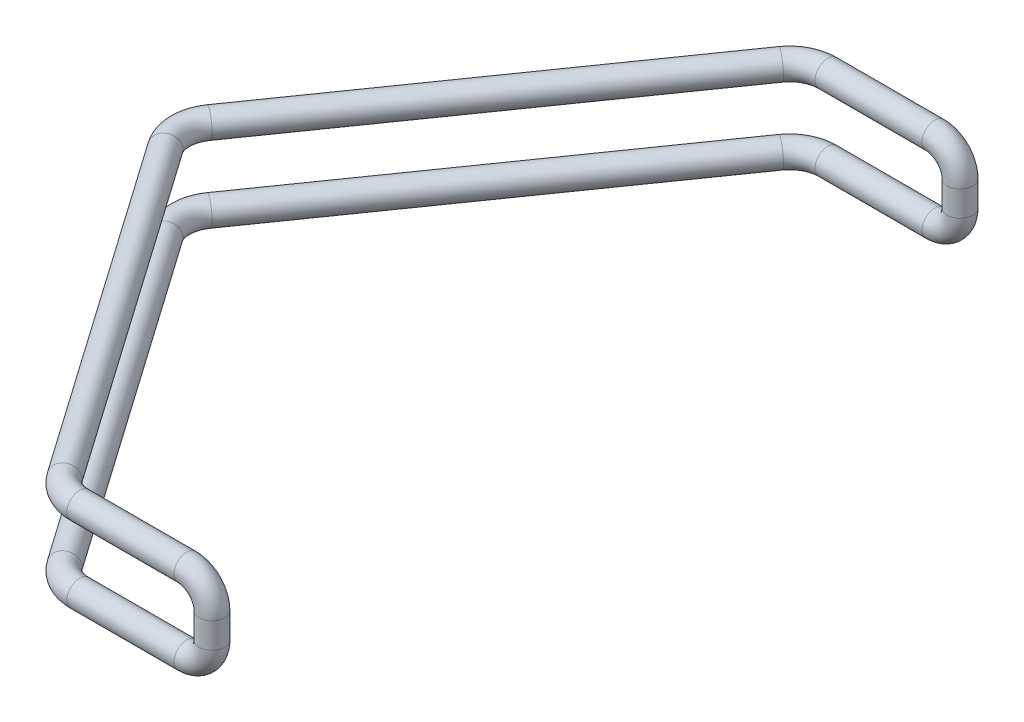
ISO-10303-21;
HEADER;
FILE_DESCRIPTION(('STEP AP214'),'2;1');
FILE_NAME('part.step','',(''),(''),'','','');
FILE_SCHEMA(('AUTOMOTIVE_DESIGN { 1 0 10303 214 1 1 1 1 }'));
ENDSEC;
DATA;
#1=APPLICATION_CONTEXT('core data for automotive mechanical design processes');
#2=APPLICATION_PROTOCOL_DEFINITION('international standard','automotive_design',2000,#1);
#3=PRODUCT_CONTEXT('',#1,'mechanical');
#4=PRODUCT('Part','Part','',(#3));
#5=PRODUCT_RELATED_PRODUCT_CATEGORY('part','',(#4));
#6=PRODUCT_DEFINITION_FORMATION('','',#4);
#7=PRODUCT_DEFINITION_CONTEXT('part definition',#1,'design');
#8=PRODUCT_DEFINITION('design','',#6,#7);
#9=PRODUCT_DEFINITION_SHAPE('','',#8);
#10=(LENGTH_UNIT() NAMED_UNIT(*) SI_UNIT(.MILLI.,.METRE.));
#11=(NAMED_UNIT(*) PLANE_ANGLE_UNIT() SI_UNIT($,.RADIAN.));
#12=(NAMED_UNIT(*) SI_UNIT($,.STERADIAN.) SOLID_ANGLE_UNIT());
#13=UNCERTAINTY_MEASURE_WITH_UNIT(LENGTH_MEASURE(1.E-05),#10,'distance_accuracy_value','');
#14=(GEOMETRIC_REPRESENTATION_CONTEXT(3) GLOBAL_UNCERTAINTY_ASSIGNED_CONTEXT((#13)) GLOBAL_UNIT_ASSIGNED_CONTEXT((#10,
#11,#12)) REPRESENTATION_CONTEXT('',''));
#15=CARTESIAN_POINT('',(0.,0.,0.));
#16=DIRECTION('',(0.,0.,1.));
#17=DIRECTION('',(1.,0.,0.));
#18=AXIS2_PLACEMENT_3D('',#15,#16,#17);
#19=CARTESIAN_POINT('',(-1.16226472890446E-13,3.17499999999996,187.258157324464));
#20=DIRECTION('',(0.,-1.,0.));
#21=DIRECTION('',(0.,0.,-1.));
#22=AXIS2_PLACEMENT_3D('',#19,#20,#21);
#23=CYLINDRICAL_SURFACE('',#22,3.175);
#24=CARTESIAN_POINT('',(-1.16226472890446E-13,3.17499999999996,187.258157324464));
#25=DIRECTION('',(0.,-1.,0.));
#26=DIRECTION('',(0.,0.,-1.));
#27=AXIS2_PLACEMENT_3D('',#24,#25,#26);
#28=CIRCLE('',#27,3.175);
#29=CARTESIAN_POINT('',(3.17499999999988,3.17499999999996,187.258157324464));
#30=VERTEX_POINT('',#29);
#31=EDGE_CURVE('E10',#30,#30,#28,.T.);
#32=ORIENTED_EDGE('',*,*,#31,.T.);
#33=EDGE_LOOP('',(#32));
#34=FACE_BOUND('',#33,.T.);
#35=CARTESIAN_POINT('',(-1.16226472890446E-13,-3.17499999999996,187.258157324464));
#36=DIRECTION('',(0.,-1.,0.));
#37=DIRECTION('',(0.,0.,-1.));
#38=AXIS2_PLACEMENT_3D('',#35,#36,#37);
#39=CIRCLE('',#38,3.175);
#40=CARTESIAN_POINT('',(3.17499999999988,-3.17499999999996,187.258157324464));
#41=VERTEX_POINT('',#40);
#42=EDGE_CURVE('E69',#41,#41,#39,.T.);
#43=ORIENTED_EDGE('',*,*,#42,.F.);
#44=EDGE_LOOP('',(#43));
#45=FACE_BOUND('',#44,.T.);
#46=ADVANCED_FACE('F32',(#34,#45),#23,.T.);
#47=CARTESIAN_POINT('',(-6.35000000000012,3.17499999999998,187.258157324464));
#48=DIRECTION('',(0.,0.,-1.));
#49=DIRECTION('',(0.,1.,0.));
#50=AXIS2_PLACEMENT_3D('',#47,#48,#49);
#51=TOROIDAL_SURFACE('',#50,6.35,3.175);
#52=CARTESIAN_POINT('',(-6.3500000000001,9.52499999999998,187.258157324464));
#53=DIRECTION('',(1.,0.,0.));
#54=DIRECTION('',(0.,0.,-1.));
#55=AXIS2_PLACEMENT_3D('',#52,#53,#54);
#56=CIRCLE('',#55,3.175);
#57=CARTESIAN_POINT('',(-6.35000000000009,12.7,187.258157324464));
#58=VERTEX_POINT('',#57);
#59=EDGE_CURVE('E38',#58,#58,#56,.T.);
#60=CARTESIAN_POINT('',(-6.35000000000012,3.17499999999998,187.258157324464));
#61=DIRECTION('',(0.,0.,-1.));
#62=DIRECTION('',(0.,1.,0.));
#63=AXIS2_PLACEMENT_3D('',#60,#61,#62);
#64=CIRCLE('',#63,9.525);
#65=EDGE_CURVE('',#58,#30,#64,.T.);
#66=ORIENTED_EDGE('',*,*,#59,.T.);
#67=ORIENTED_EDGE('',*,*,#31,.F.);
#68=ORIENTED_EDGE('',*,*,#65,.T.);
#69=ORIENTED_EDGE('',*,*,#65,.F.);
#70=EDGE_LOOP('',(#66,#68,#67,#69));
#71=FACE_BOUND('',#70,.T.);
#72=ADVANCED_FACE('F157',(#71),#51,.T.);
#73=CARTESIAN_POINT('',(-33.1415988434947,9.52499999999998,187.258157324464));
#74=DIRECTION('',(1.,0.,0.));
#75=DIRECTION('',(0.,0.,-1.));
#76=AXIS2_PLACEMENT_3D('',#73,#74,#75);
#77=CYLINDRICAL_SURFACE('',#76,3.175);
#78=CARTESIAN_POINT('',(-33.1415988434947,9.52499999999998,187.258157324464));
#79=DIRECTION('',(1.,0.,0.));
#80=DIRECTION('',(0.,0.,-1.));
#81=AXIS2_PLACEMENT_3D('',#78,#79,#80);
#82=CIRCLE('',#81,3.175);
#83=CARTESIAN_POINT('',(-33.1415988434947,9.52499999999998,190.433157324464));
#84=VERTEX_POINT('',#83);
#85=EDGE_CURVE('E42',#84,#84,#82,.T.);
#86=ORIENTED_EDGE('',*,*,#85,.T.);
#87=EDGE_LOOP('',(#86));
#88=FACE_BOUND('',#87,.T.);
#89=ORIENTED_EDGE('',*,*,#59,.F.);
#90=EDGE_LOOP('',(#89));
#91=FACE_BOUND('',#90,.T.);
#92=ADVANCED_FACE('F161',(#88,#91),#77,.T.);
#93=CARTESIAN_POINT('',(-33.1415988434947,9.52499999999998,177.733157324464));
#94=DIRECTION('',(0.,1.,0.));
#95=DIRECTION('',(0.,0.,1.));
#96=AXIS2_PLACEMENT_3D('',#93,#94,#95);
#97=TOROIDAL_SURFACE('',#96,9.525,3.175);
#98=CARTESIAN_POINT('',(-40.9440220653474,9.52499999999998,183.196472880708));
#99=DIRECTION('',(0.57357643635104,0.,0.819152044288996));
#100=DIRECTION('',(0.819152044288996,0.,-0.57357643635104));
#101=AXIS2_PLACEMENT_3D('',#98,#99,#100);
#102=CIRCLE('',#101,3.175);
#103=CARTESIAN_POINT('',(-43.5448298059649,9.52499999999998,185.017578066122));
#104=VERTEX_POINT('',#103);
#105=EDGE_CURVE('E46',#104,#104,#102,.T.);
#106=CARTESIAN_POINT('',(-33.1415988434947,9.52499999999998,177.733157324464));
#107=DIRECTION('',(0.,1.,0.));
#108=DIRECTION('',(0.,0.,1.));
#109=AXIS2_PLACEMENT_3D('',#106,#107,#108);
#110=CIRCLE('',#109,12.7);
#111=EDGE_CURVE('',#104,#84,#110,.T.);
#112=ORIENTED_EDGE('',*,*,#105,.T.);
#113=ORIENTED_EDGE('',*,*,#85,.F.);
#114=ORIENTED_EDGE('',*,*,#111,.T.);
#115=ORIENTED_EDGE('',*,*,#111,.F.);
#116=EDGE_LOOP('',(#112,#114,#113,#115));
#117=FACE_BOUND('',#116,.T.);
#118=ADVANCED_FACE('F165',(#117),#97,.T.);
#119=CARTESIAN_POINT('',(-99.8343319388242,9.52499999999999,99.0923942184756));
#120=DIRECTION('',(0.573576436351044,0.,0.819152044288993));
#121=DIRECTION('',(0.819152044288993,0.,-0.573576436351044));
#122=AXIS2_PLACEMENT_3D('',#119,#120,#121);
#123=CYLINDRICAL_SURFACE('',#122,3.175);
#124=CARTESIAN_POINT('',(-99.8343319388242,9.52499999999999,99.0923942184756));
#125=DIRECTION('',(0.57357643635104,0.,0.819152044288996));
#126=DIRECTION('',(0.819152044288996,0.,-0.57357643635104));
#127=AXIS2_PLACEMENT_3D('',#124,#125,#126);
#128=CIRCLE('',#127,3.175);
#129=CARTESIAN_POINT('',(-102.435139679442,9.52499999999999,100.91349940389));
#130=VERTEX_POINT('',#129);
#131=EDGE_CURVE('E51',#130,#130,#128,.T.);
#132=ORIENTED_EDGE('',*,*,#131,.T.);
#133=EDGE_LOOP('',(#132));
#134=FACE_BOUND('',#133,.T.);
#135=ORIENTED_EDGE('',*,*,#105,.F.);
#136=EDGE_LOOP('',(#135));
#137=FACE_BOUND('',#136,.T.);
#138=ADVANCED_FACE('F172',(#134,#137),#123,.T.);
#139=CARTESIAN_POINT('',(-92.0319087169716,9.52499999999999,93.6290786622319));
#140=DIRECTION('',(0.,1.,0.));
#141=DIRECTION('',(0.,0.,1.));
#142=AXIS2_PLACEMENT_3D('',#139,#140,#141);
#143=TOROIDAL_SURFACE('',#142,9.525,3.175);
#144=CARTESIAN_POINT('',(-99.8343319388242,9.52499999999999,88.1657631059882));
#145=DIRECTION('',(-0.573576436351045,0.,0.819152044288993));
#146=DIRECTION('',(0.819152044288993,0.,0.573576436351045));
#147=AXIS2_PLACEMENT_3D('',#144,#145,#146);
#148=CIRCLE('',#147,3.175);
#149=CARTESIAN_POINT('',(-102.435139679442,9.52499999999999,86.3446579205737));
#150=VERTEX_POINT('',#149);
#151=EDGE_CURVE('E54',#150,#150,#148,.T.);
#152=CARTESIAN_POINT('',(-92.0319087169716,9.52499999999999,93.6290786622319));
#153=DIRECTION('',(0.,1.,0.));
#154=DIRECTION('',(0.,0.,1.));
#155=AXIS2_PLACEMENT_3D('',#152,#153,#154);
#156=CIRCLE('',#155,12.7);
#157=EDGE_CURVE('',#150,#130,#156,.T.);
#158=ORIENTED_EDGE('',*,*,#151,.T.);
#159=ORIENTED_EDGE('',*,*,#131,.F.);
#160=ORIENTED_EDGE('',*,*,#157,.T.);
#161=ORIENTED_EDGE('',*,*,#157,.F.);
#162=EDGE_LOOP('',(#158,#160,#159,#161));
#163=FACE_BOUND('',#162,.T.);
#164=ADVANCED_FACE('F176',(#163),#143,.T.);
#165=CARTESIAN_POINT('',(-40.9440220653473,9.525,4.0616844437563));
#166=DIRECTION('',(-0.573576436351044,0.,0.819152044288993));
#167=DIRECTION('',(0.819152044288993,0.,0.573576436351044));
#168=AXIS2_PLACEMENT_3D('',#165,#166,#167);
#169=CYLINDRICAL_SURFACE('',#168,3.175);
#170=CARTESIAN_POINT('',(-40.9440220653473,9.525,4.0616844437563));
#171=DIRECTION('',(-0.573576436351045,0.,0.819152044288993));
#172=DIRECTION('',(0.819152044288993,0.,0.573576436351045));
#173=AXIS2_PLACEMENT_3D('',#170,#171,#172);
#174=CIRCLE('',#173,3.175);
#175=CARTESIAN_POINT('',(-43.5448298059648,9.525,2.24057925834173));
#176=VERTEX_POINT('',#175);
#177=EDGE_CURVE('E57',#176,#176,#174,.T.);
#178=ORIENTED_EDGE('',*,*,#177,.T.);
#179=EDGE_LOOP('',(#178));
#180=FACE_BOUND('',#179,.T.);
#181=ORIENTED_EDGE('',*,*,#151,.F.);
#182=EDGE_LOOP('',(#181));
#183=FACE_BOUND('',#182,.T.);
#184=ADVANCED_FACE('F180',(#180,#183),#169,.T.);
#185=CARTESIAN_POINT('',(-33.1415988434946,9.525,9.525));
#186=DIRECTION('',(0.,1.,0.));
#187=DIRECTION('',(0.,0.,1.));
#188=AXIS2_PLACEMENT_3D('',#185,#186,#187);
#189=TOROIDAL_SURFACE('',#188,9.525,3.175);
#190=CARTESIAN_POINT('',(-33.1415988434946,9.525,0.));
#191=DIRECTION('',(-1.,0.,0.));
#192=DIRECTION('',(0.,0.,1.));
#193=AXIS2_PLACEMENT_3D('',#190,#191,#192);
#194=CIRCLE('',#193,3.175);
#195=CARTESIAN_POINT('',(-33.1415988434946,9.525,-3.175));
#196=VERTEX_POINT('',#195);
#197=EDGE_CURVE('E60',#196,#196,#194,.T.);
#198=CARTESIAN_POINT('',(-33.1415988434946,9.525,9.525));
#199=DIRECTION('',(0.,1.,0.));
#200=DIRECTION('',(0.,0.,1.));
#201=AXIS2_PLACEMENT_3D('',#198,#199,#200);
#202=CIRCLE('',#201,12.7);
#203=EDGE_CURVE('',#196,#176,#202,.T.);
#204=ORIENTED_EDGE('',*,*,#197,.T.);
#205=ORIENTED_EDGE('',*,*,#177,.F.);
#206=ORIENTED_EDGE('',*,*,#203,.T.);
#207=ORIENTED_EDGE('',*,*,#203,.F.);
#208=EDGE_LOOP('',(#204,#206,#205,#207));
#209=FACE_BOUND('',#208,.T.);
#210=ADVANCED_FACE('F184',(#209),#189,.T.);
#211=CARTESIAN_POINT('',(-6.35,9.525,0.));
#212=DIRECTION('',(-1.,0.,0.));
#213=DIRECTION('',(0.,0.,1.));
#214=AXIS2_PLACEMENT_3D('',#211,#212,#213);
#215=CYLINDRICAL_SURFACE('',#214,3.175);
#216=CARTESIAN_POINT('',(-6.35,9.525,0.));
#217=DIRECTION('',(-1.,0.,0.));
#218=DIRECTION('',(0.,0.,1.));
#219=AXIS2_PLACEMENT_3D('',#216,#217,#218);
#220=CIRCLE('',#219,3.175);
#221=CARTESIAN_POINT('',(-6.35,12.7,0.));
#222=VERTEX_POINT('',#221);
#223=EDGE_CURVE('E63',#222,#222,#220,.T.);
#224=ORIENTED_EDGE('',*,*,#223,.T.);
#225=EDGE_LOOP('',(#224));
#226=FACE_BOUND('',#225,.T.);
#227=ORIENTED_EDGE('',*,*,#197,.F.);
#228=EDGE_LOOP('',(#227));
#229=FACE_BOUND('',#228,.T.);
#230=ADVANCED_FACE('F188',(#226,#229),#215,.T.);
#231=CARTESIAN_POINT('',(-6.35,3.175,0.));
#232=DIRECTION('',(0.,0.,1.));
#233=DIRECTION('',(1.,0.,0.));
#234=AXIS2_PLACEMENT_3D('',#231,#232,#233);
#235=TOROIDAL_SURFACE('',#234,6.35,3.175);
#236=CARTESIAN_POINT('',(0.,3.175,0.));
#237=DIRECTION('',(0.,1.,0.));
#238=DIRECTION('',(0.,0.,1.));
#239=AXIS2_PLACEMENT_3D('',#236,#237,#238);
#240=CIRCLE('',#239,3.175);
#241=CARTESIAN_POINT('',(3.175,3.175,0.));
#242=VERTEX_POINT('',#241);
#243=EDGE_CURVE('E66',#242,#242,#240,.T.);
#244=CARTESIAN_POINT('',(-6.35,3.175,0.));
#245=DIRECTION('',(0.,0.,1.));
#246=DIRECTION('',(1.,0.,0.));
#247=AXIS2_PLACEMENT_3D('',#244,#245,#246);
#248=CIRCLE('',#247,9.525);
#249=EDGE_CURVE('',#242,#222,#248,.T.);
#250=ORIENTED_EDGE('',*,*,#243,.T.);
#251=ORIENTED_EDGE('',*,*,#223,.F.);
#252=ORIENTED_EDGE('',*,*,#249,.T.);
#253=ORIENTED_EDGE('',*,*,#249,.F.);
#254=EDGE_LOOP('',(#250,#252,#251,#253));
#255=FACE_BOUND('',#254,.T.);
#256=ADVANCED_FACE('F192',(#255),#235,.T.);
#257=CARTESIAN_POINT('',(0.,3.175,0.));
#258=DIRECTION('',(0.,-1.,0.));
#259=DIRECTION('',(0.,0.,-1.));
#260=AXIS2_PLACEMENT_3D('',#257,#258,#259);
#261=CYLINDRICAL_SURFACE('',#260,3.175);
#262=ORIENTED_EDGE('',*,*,#243,.F.);
#263=EDGE_LOOP('',(#262));
#264=FACE_BOUND('',#263,.T.);
#265=CARTESIAN_POINT('',(0.,-3.175,0.));
#266=DIRECTION('',(0.,1.,0.));
#267=DIRECTION('',(0.,0.,1.));
#268=AXIS2_PLACEMENT_3D('',#265,#266,#267);
#269=CIRCLE('',#268,3.175);
#270=CARTESIAN_POINT('',(3.175,-3.175,0.));
#271=VERTEX_POINT('',#270);
#272=EDGE_CURVE('E96',#271,#271,#269,.T.);
#273=ORIENTED_EDGE('',*,*,#272,.T.);
#274=EDGE_LOOP('',(#273));
#275=FACE_BOUND('',#274,.T.);
#276=ADVANCED_FACE('F100',(#264,#275),#261,.T.);
#277=CARTESIAN_POINT('',(-6.35000000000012,-3.17499999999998,187.258157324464));
#278=DIRECTION('',(0.,0.,1.));
#279=DIRECTION('',(0.,-1.,0.));
#280=AXIS2_PLACEMENT_3D('',#277,#278,#279);
#281=TOROIDAL_SURFACE('',#280,6.35,3.175);
#282=CARTESIAN_POINT('',(-6.3500000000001,-9.52499999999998,187.258157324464));
#283=DIRECTION('',(-1.,0.,0.));
#284=DIRECTION('',(0.,0.,-1.));
#285=AXIS2_PLACEMENT_3D('',#282,#283,#284);
#286=CIRCLE('',#285,3.175);
#287=CARTESIAN_POINT('',(-6.35000000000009,-12.7,187.258157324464));
#288=VERTEX_POINT('',#287);
#289=EDGE_CURVE('E72',#288,#288,#286,.T.);
#290=CARTESIAN_POINT('',(-6.35000000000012,-3.17499999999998,187.258157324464));
#291=DIRECTION('',(0.,0.,1.));
#292=DIRECTION('',(0.,-1.,0.));
#293=AXIS2_PLACEMENT_3D('',#290,#291,#292);
#294=CIRCLE('',#293,9.525);
#295=EDGE_CURVE('',#288,#41,#294,.T.);
#296=ORIENTED_EDGE('',*,*,#289,.F.);
#297=ORIENTED_EDGE('',*,*,#42,.T.);
#298=ORIENTED_EDGE('',*,*,#295,.T.);
#299=ORIENTED_EDGE('',*,*,#295,.F.);
#300=EDGE_LOOP('',(#296,#298,#297,#299));
#301=FACE_BOUND('',#300,.T.);
#302=ADVANCED_FACE('F147',(#301),#281,.T.);
#303=CARTESIAN_POINT('',(-33.1415988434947,-9.52499999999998,187.258157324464));
#304=DIRECTION('',(1.,0.,0.));
#305=DIRECTION('',(0.,0.,-1.));
#306=AXIS2_PLACEMENT_3D('',#303,#304,#305);
#307=CYLINDRICAL_SURFACE('',#306,3.175);
#308=CARTESIAN_POINT('',(-33.1415988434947,-9.52499999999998,187.258157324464));
#309=DIRECTION('',(-1.,0.,0.));
#310=DIRECTION('',(0.,0.,-1.));
#311=AXIS2_PLACEMENT_3D('',#308,#309,#310);
#312=CIRCLE('',#311,3.175);
#313=CARTESIAN_POINT('',(-33.1415988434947,-9.52499999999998,190.433157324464));
#314=VERTEX_POINT('',#313);
#315=EDGE_CURVE('E75',#314,#314,#312,.T.);
#316=ORIENTED_EDGE('',*,*,#315,.F.);
#317=EDGE_LOOP('',(#316));
#318=FACE_BOUND('',#317,.T.);
#319=ORIENTED_EDGE('',*,*,#289,.T.);
#320=EDGE_LOOP('',(#319));
#321=FACE_BOUND('',#320,.T.);
#322=ADVANCED_FACE('F141',(#318,#321),#307,.T.);
#323=CARTESIAN_POINT('',(-33.1415988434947,-9.52499999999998,177.733157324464));
#324=DIRECTION('',(0.,1.,0.));
#325=DIRECTION('',(0.,0.,1.));
#326=AXIS2_PLACEMENT_3D('',#323,#324,#325);
#327=TOROIDAL_SURFACE('',#326,9.525,3.175);
#328=CARTESIAN_POINT('',(-40.9440220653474,-9.52499999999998,183.196472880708));
#329=DIRECTION('',(-0.57357643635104,0.,-0.819152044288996));
#330=DIRECTION('',(0.819152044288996,0.,-0.57357643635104));
#331=AXIS2_PLACEMENT_3D('',#328,#329,#330);
#332=CIRCLE('',#331,3.175);
#333=CARTESIAN_POINT('',(-43.5448298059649,-9.52499999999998,185.017578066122));
#334=VERTEX_POINT('',#333);
#335=EDGE_CURVE('E78',#334,#334,#332,.T.);
#336=CARTESIAN_POINT('',(-33.1415988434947,-9.52499999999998,177.733157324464));
#337=DIRECTION('',(0.,1.,0.));
#338=DIRECTION('',(0.,0.,1.));
#339=AXIS2_PLACEMENT_3D('',#336,#337,#338);
#340=CIRCLE('',#339,12.7);
#341=EDGE_CURVE('',#334,#314,#340,.T.);
#342=ORIENTED_EDGE('',*,*,#335,.F.);
#343=ORIENTED_EDGE('',*,*,#315,.T.);
#344=ORIENTED_EDGE('',*,*,#341,.T.);
#345=ORIENTED_EDGE('',*,*,#341,.F.);
#346=EDGE_LOOP('',(#342,#344,#343,#345));
#347=FACE_BOUND('',#346,.T.);
#348=ADVANCED_FACE('F135',(#347),#327,.T.);
#349=CARTESIAN_POINT('',(-99.8343319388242,-9.52499999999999,99.0923942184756));
#350=DIRECTION('',(0.573576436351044,0.,0.819152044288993));
#351=DIRECTION('',(0.819152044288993,0.,-0.573576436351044));
#352=AXIS2_PLACEMENT_3D('',#349,#350,#351);
#353=CYLINDRICAL_SURFACE('',#352,3.175);
#354=CARTESIAN_POINT('',(-99.8343319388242,-9.52499999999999,99.0923942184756));
#355=DIRECTION('',(-0.57357643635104,0.,-0.819152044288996));
#356=DIRECTION('',(0.819152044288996,0.,-0.57357643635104));
#357=AXIS2_PLACEMENT_3D('',#354,#355,#356);
#358=CIRCLE('',#357,3.175);
#359=CARTESIAN_POINT('',(-102.435139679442,-9.52499999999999,100.91349940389));
#360=VERTEX_POINT('',#359);
#361=EDGE_CURVE('E81',#360,#360,#358,.T.);
#362=ORIENTED_EDGE('',*,*,#361,.F.);
#363=EDGE_LOOP('',(#362));
#364=FACE_BOUND('',#363,.T.);
#365=ORIENTED_EDGE('',*,*,#335,.T.);
#366=EDGE_LOOP('',(#365));
#367=FACE_BOUND('',#366,.T.);
#368=ADVANCED_FACE('F129',(#364,#367),#353,.T.);
#369=CARTESIAN_POINT('',(-92.0319087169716,-9.52499999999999,93.6290786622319));
#370=DIRECTION('',(0.,1.,0.));
#371=DIRECTION('',(0.,0.,1.));
#372=AXIS2_PLACEMENT_3D('',#369,#370,#371);
#373=TOROIDAL_SURFACE('',#372,9.525,3.175);
#374=CARTESIAN_POINT('',(-99.8343319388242,-9.52499999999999,88.1657631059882));
#375=DIRECTION('',(0.573576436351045,0.,-0.819152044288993));
#376=DIRECTION('',(0.819152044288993,0.,0.573576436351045));
#377=AXIS2_PLACEMENT_3D('',#374,#375,#376);
#378=CIRCLE('',#377,3.175);
#379=CARTESIAN_POINT('',(-102.435139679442,-9.52499999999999,86.3446579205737));
#380=VERTEX_POINT('',#379);
#381=EDGE_CURVE('E84',#380,#380,#378,.T.);
#382=CARTESIAN_POINT('',(-92.0319087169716,-9.52499999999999,93.6290786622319));
#383=DIRECTION('',(0.,1.,0.));
#384=DIRECTION('',(0.,0.,1.));
#385=AXIS2_PLACEMENT_3D('',#382,#383,#384);
#386=CIRCLE('',#385,12.7);
#387=EDGE_CURVE('',#380,#360,#386,.T.);
#388=ORIENTED_EDGE('',*,*,#381,.F.);
#389=ORIENTED_EDGE('',*,*,#361,.T.);
#390=ORIENTED_EDGE('',*,*,#387,.T.);
#391=ORIENTED_EDGE('',*,*,#387,.F.);
#392=EDGE_LOOP('',(#388,#390,#389,#391));
#393=FACE_BOUND('',#392,.T.);
#394=ADVANCED_FACE('F123',(#393),#373,.T.);
#395=CARTESIAN_POINT('',(-40.9440220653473,-9.525,4.0616844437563));
#396=DIRECTION('',(-0.573576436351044,0.,0.819152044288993));
#397=DIRECTION('',(0.819152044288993,0.,0.573576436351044));
#398=AXIS2_PLACEMENT_3D('',#395,#396,#397);
#399=CYLINDRICAL_SURFACE('',#398,3.175);
#400=CARTESIAN_POINT('',(-40.9440220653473,-9.525,4.0616844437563));
#401=DIRECTION('',(0.573576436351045,0.,-0.819152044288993));
#402=DIRECTION('',(0.819152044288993,0.,0.573576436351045));
#403=AXIS2_PLACEMENT_3D('',#400,#401,#402);
#404=CIRCLE('',#403,3.175);
#405=CARTESIAN_POINT('',(-43.5448298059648,-9.525,2.24057925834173));
#406=VERTEX_POINT('',#405);
#407=EDGE_CURVE('E87',#406,#406,#404,.T.);
#408=ORIENTED_EDGE('',*,*,#407,.F.);
#409=EDGE_LOOP('',(#408));
#410=FACE_BOUND('',#409,.T.);
#411=ORIENTED_EDGE('',*,*,#381,.T.);
#412=EDGE_LOOP('',(#411));
#413=FACE_BOUND('',#412,.T.);
#414=ADVANCED_FACE('F117',(#410,#413),#399,.T.);
#415=CARTESIAN_POINT('',(-33.1415988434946,-9.525,9.525));
#416=DIRECTION('',(0.,1.,0.));
#417=DIRECTION('',(0.,0.,1.));
#418=AXIS2_PLACEMENT_3D('',#415,#416,#417);
#419=TOROIDAL_SURFACE('',#418,9.525,3.175);
#420=CARTESIAN_POINT('',(-33.1415988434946,-9.525,0.));
#421=DIRECTION('',(1.,0.,0.));
#422=DIRECTION('',(0.,0.,1.));
#423=AXIS2_PLACEMENT_3D('',#420,#421,#422);
#424=CIRCLE('',#423,3.175);
#425=CARTESIAN_POINT('',(-33.1415988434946,-9.525,-3.175));
#426=VERTEX_POINT('',#425);
#427=EDGE_CURVE('E90',#426,#426,#424,.T.);
#428=CARTESIAN_POINT('',(-33.1415988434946,-9.525,9.525));
#429=DIRECTION('',(0.,1.,0.));
#430=DIRECTION('',(0.,0.,1.));
#431=AXIS2_PLACEMENT_3D('',#428,#429,#430);
#432=CIRCLE('',#431,12.7);
#433=EDGE_CURVE('',#426,#406,#432,.T.);
#434=ORIENTED_EDGE('',*,*,#427,.F.);
#435=ORIENTED_EDGE('',*,*,#407,.T.);
#436=ORIENTED_EDGE('',*,*,#433,.T.);
#437=ORIENTED_EDGE('',*,*,#433,.F.);
#438=EDGE_LOOP('',(#434,#436,#435,#437));
#439=FACE_BOUND('',#438,.T.);
#440=ADVANCED_FACE('F111',(#439),#419,.T.);
#441=CARTESIAN_POINT('',(-6.35,-9.525,0.));
#442=DIRECTION('',(-1.,0.,0.));
#443=DIRECTION('',(0.,0.,1.));
#444=AXIS2_PLACEMENT_3D('',#441,#442,#443);
#445=CYLINDRICAL_SURFACE('',#444,3.175);
#446=CARTESIAN_POINT('',(-6.35,-9.525,0.));
#447=DIRECTION('',(1.,0.,0.));
#448=DIRECTION('',(0.,0.,1.));
#449=AXIS2_PLACEMENT_3D('',#446,#447,#448);
#450=CIRCLE('',#449,3.175);
#451=CARTESIAN_POINT('',(-6.35,-12.7,0.));
#452=VERTEX_POINT('',#451);
#453=EDGE_CURVE('E93',#452,#452,#450,.T.);
#454=ORIENTED_EDGE('',*,*,#453,.F.);
#455=EDGE_LOOP('',(#454));
#456=FACE_BOUND('',#455,.T.);
#457=ORIENTED_EDGE('',*,*,#427,.T.);
#458=EDGE_LOOP('',(#457));
#459=FACE_BOUND('',#458,.T.);
#460=ADVANCED_FACE('F105',(#456,#459),#445,.T.);
#461=CARTESIAN_POINT('',(-6.35,-3.175,0.));
#462=DIRECTION('',(0.,0.,-1.));
#463=DIRECTION('',(-1.,0.,0.));
#464=AXIS2_PLACEMENT_3D('',#461,#462,#463);
#465=TOROIDAL_SURFACE('',#464,6.35,3.175);
#466=CARTESIAN_POINT('',(-6.35,-3.175,0.));
#467=DIRECTION('',(0.,0.,-1.));
#468=DIRECTION('',(-1.,0.,0.));
#469=AXIS2_PLACEMENT_3D('',#466,#467,#468);
#470=CIRCLE('',#469,9.525);
#471=EDGE_CURVE('',#271,#452,#470,.T.);
#472=ORIENTED_EDGE('',*,*,#272,.F.);
#473=ORIENTED_EDGE('',*,*,#453,.T.);
#474=ORIENTED_EDGE('',*,*,#471,.T.);
#475=ORIENTED_EDGE('',*,*,#471,.F.);
#476=EDGE_LOOP('',(#472,#474,#473,#475));
#477=FACE_BOUND('',#476,.T.);
#478=ADVANCED_FACE('F102',(#477),#465,.T.);
#479=CLOSED_SHELL('',(#46,#72,#92,#118,#138,#164,#184,#210,#230,#256,#276,#302,#322,#348,#368,
#394,#414,#440,#460,#478));
#480=MANIFOLD_SOLID_BREP('B2',#479);
#481=ADVANCED_BREP_SHAPE_REPRESENTATION('',(#18,#480),#14);
#482=SHAPE_DEFINITION_REPRESENTATION(#9,#481);
ENDSEC;
END-ISO-10303-21;
